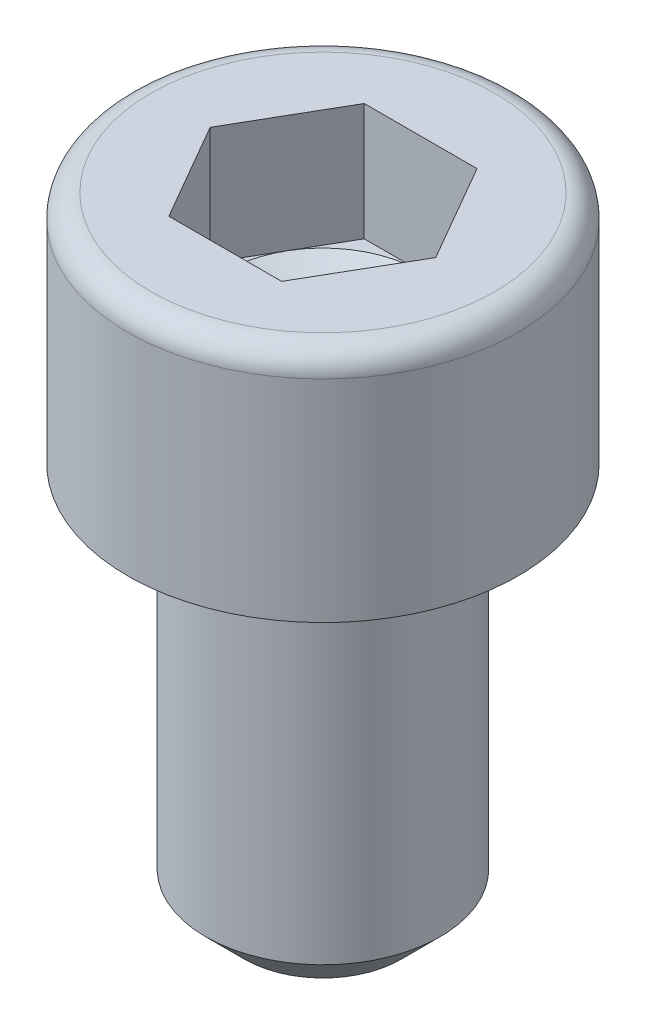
from build123d import *

# Parameters (mm, degrees)
TIGE_START              = -10
ESQUISSE1_R             = 3
TIGE_DEPTH              = 10
CHANFREIN_D_ENTR_E_SIZE = 1
HEXAGONE_DEPTH          = 3


with BuildPart() as part:
    # Esquisse1 → Tige (new body)
    with BuildSketch(Plane(origin=(0, 0, 0), x_dir=(1, 0, 0), z_dir=(0, 1, 0)).offset(TIGE_START)):
        with Locations(Location((0, 0, 0), (0, 0, 270))):
            Circle(ESQUISSE1_R)
    extrude(amount=TIGE_DEPTH)

    # Chanfrein d_entr_e
    chanfrein_d_entr_e_edges = [part.edges().sort_by_distance(p)[0] for p in [
        (0, -10, -3),
    ]]
    chamfer(chanfrein_d_entr_e_edges, length=CHANFREIN_D_ENTR_E_SIZE)

    # Esquisse2 → T_te (revolve)
    with BuildSketch(Plane.XY, mode=Mode.PRIVATE) as t_te_sk:
        with BuildLine():
            Line((2.5, 6), (2.5, 3))
            Line((2.5, 3), (0, 1.556624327))
            Line((0, 1.556624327), (0, 0))
            Line((0, 0), (5, 0))
            Line((5, 0), (5, 5.4))
            ThreePointArc((5, 5.4), (4.824264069, 5.824264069), (4.4, 6))
            Line((4.4, 6), (2.5, 6))
        make_face()
    revolve(t_te_sk.sketch.rotate(Axis((0, 6, 0), (0, -1, 0)), 180), axis=Axis((0, 6, 0), (0, -1, 0)))

    # Esquisse3 → Hexagone (cut)
    with BuildSketch(Plane(origin=(0, 6, -3), x_dir=(1, 0, 0), z_dir=(0, -1, 0))):
        Polygon((1.443375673, 5.5), (-1.443375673, 5.5), (-2.886751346, 3), (-1.443375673, 0.5), (1.443375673, 0.5), (2.886751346, 3), align=None)
    extrude(amount=HEXAGONE_DEPTH, mode=Mode.SUBTRACT)


solid = part.part
